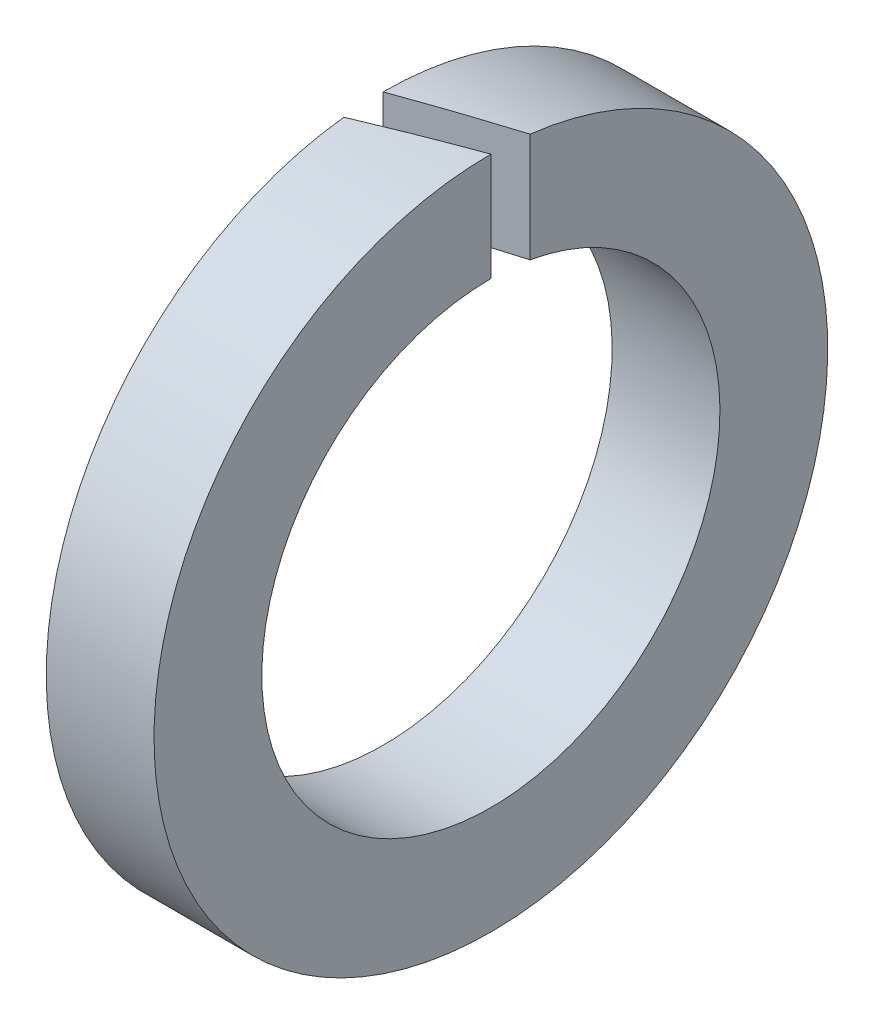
from build123d import *

# Parameters (mm, degrees)
ESQUISSE1_W             = 4
ESQUISSE1_H             = 4
ENL_V_MAT_EXTRU_1_DEPTH = 19.12456896


with BuildPart() as part:
    # Esquisse1 → Base-R_volution (revolve)
    with BuildSketch(Plane(origin=(0, 0, 0), x_dir=(1, 0, 0), z_dir=(0, 1, 0)), mode=Mode.PRIVATE) as base_r_volution_sk:
        with Locations((2, 10.5)):
            Rectangle(ESQUISSE1_W, ESQUISSE1_H)
    revolve(base_r_volution_sk.sketch.rotate(Axis((0, 0, 0), (1, 0, 0)), 180), axis=Axis((0, 0, 0), (1, 0, 0)))

    # Esquisse2 → Enl_v. mat.-Extru.1 (cut, through all)
    with BuildSketch(Plane(origin=(0, 0, 0), x_dir=(1, 0, 0), z_dir=(0, 1, 0))):
        Polygon((0, 0), (4, 1.455880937), (4, 0), (0, -1.455880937), align=None)
    extrude(amount=ENL_V_MAT_EXTRU_1_DEPTH, mode=Mode.SUBTRACT)


solid = part.part
